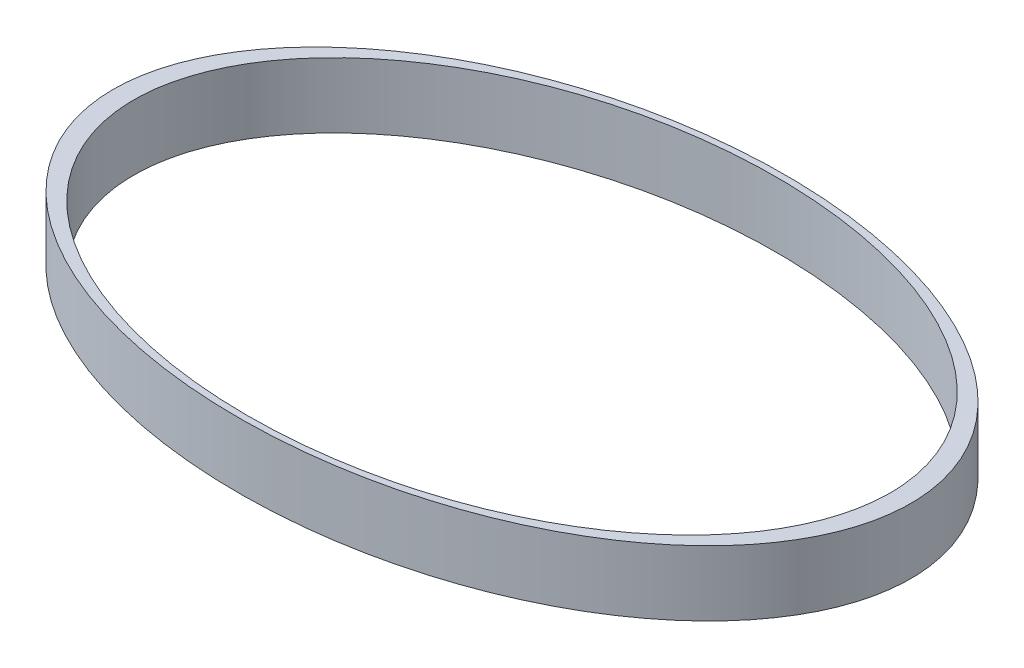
ISO-10303-21;
HEADER;
FILE_DESCRIPTION(('STEP AP214'),'2;1');
FILE_NAME('part.step','',(''),(''),'','','');
FILE_SCHEMA(('AUTOMOTIVE_DESIGN { 1 0 10303 214 1 1 1 1 }'));
ENDSEC;
DATA;
#1=APPLICATION_CONTEXT('core data for automotive mechanical design processes');
#2=APPLICATION_PROTOCOL_DEFINITION('international standard','automotive_design',2000,#1);
#3=PRODUCT_CONTEXT('',#1,'mechanical');
#4=PRODUCT('Part','Part','',(#3));
#5=PRODUCT_RELATED_PRODUCT_CATEGORY('part','',(#4));
#6=PRODUCT_DEFINITION_FORMATION('','',#4);
#7=PRODUCT_DEFINITION_CONTEXT('part definition',#1,'design');
#8=PRODUCT_DEFINITION('design','',#6,#7);
#9=PRODUCT_DEFINITION_SHAPE('','',#8);
#10=(LENGTH_UNIT() NAMED_UNIT(*) SI_UNIT(.MILLI.,.METRE.));
#11=(NAMED_UNIT(*) PLANE_ANGLE_UNIT() SI_UNIT($,.RADIAN.));
#12=(NAMED_UNIT(*) SI_UNIT($,.STERADIAN.) SOLID_ANGLE_UNIT());
#13=UNCERTAINTY_MEASURE_WITH_UNIT(LENGTH_MEASURE(1.E-05),#10,'distance_accuracy_value','');
#14=(GEOMETRIC_REPRESENTATION_CONTEXT(3) GLOBAL_UNCERTAINTY_ASSIGNED_CONTEXT((#13)) GLOBAL_UNIT_ASSIGNED_CONTEXT((#10,
#11,#12)) REPRESENTATION_CONTEXT('',''));
#15=CARTESIAN_POINT('',(0.,0.,0.));
#16=DIRECTION('',(0.,0.,1.));
#17=DIRECTION('',(1.,0.,0.));
#18=AXIS2_PLACEMENT_3D('',#15,#16,#17);
#19=CARTESIAN_POINT('',(181.503291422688,10.,2.13893643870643));
#20=DIRECTION('',(0.,1.,0.));
#21=DIRECTION('',(0.,0.,1.));
#22=AXIS2_PLACEMENT_3D('',#19,#20,#21);
#23=PLANE('',#22);
#24=CARTESIAN_POINT('',(181.503291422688,10.,2.13893643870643));
#25=DIRECTION('',(0.,1.,0.));
#26=DIRECTION('',(-0.996024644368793,0.,0.089078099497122));
#27=AXIS2_PLACEMENT_3D('',#24,#25,#26);
#28=ELLIPSE('',#27,58.2205142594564,36.8710238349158);
#29=CARTESIAN_POINT('',(123.514224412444,10.,7.3251092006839));
#30=VERTEX_POINT('',#29);
#31=EDGE_CURVE('E10',#30,#30,#28,.T.);
#32=ORIENTED_EDGE('',*,*,#31,.T.);
#33=EDGE_LOOP('',(#32));
#34=FACE_BOUND('',#33,.T.);
#35=CARTESIAN_POINT('',(181.503291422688,10.,2.13893643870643));
#36=DIRECTION('',(0.,1.,0.));
#37=DIRECTION('',(0.995811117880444,0.,-0.0914342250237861));
#38=AXIS2_PLACEMENT_3D('',#35,#36,#37);
#39=ELLIPSE('',#38,55.240939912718,35.920911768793);
#40=CARTESIAN_POINT('',(236.512833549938,10.,-2.91197609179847));
#41=VERTEX_POINT('',#40);
#42=EDGE_CURVE('E42',#41,#41,#39,.T.);
#43=ORIENTED_EDGE('',*,*,#42,.F.);
#44=EDGE_LOOP('',(#43));
#45=FACE_BOUND('',#44,.T.);
#46=ADVANCED_FACE('F31',(#34,#45),#23,.T.);
#47=CARTESIAN_POINT('',(181.503291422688,0.,2.13893643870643));
#48=DIRECTION('',(0.,1.,0.));
#49=DIRECTION('',(0.,0.,1.));
#50=AXIS2_PLACEMENT_3D('',#47,#48,#49);
#51=PLANE('',#50);
#52=CARTESIAN_POINT('',(181.503291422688,0.,2.13893643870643));
#53=DIRECTION('',(0.,1.,0.));
#54=DIRECTION('',(-0.996024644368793,0.,0.089078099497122));
#55=AXIS2_PLACEMENT_3D('',#52,#53,#54);
#56=ELLIPSE('',#55,58.2205142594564,36.8710238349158);
#57=CARTESIAN_POINT('',(123.514224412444,0.,7.3251092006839));
#58=VERTEX_POINT('',#57);
#59=EDGE_CURVE('E36',#58,#58,#56,.T.);
#60=ORIENTED_EDGE('',*,*,#59,.F.);
#61=EDGE_LOOP('',(#60));
#62=FACE_BOUND('',#61,.T.);
#63=CARTESIAN_POINT('',(181.503291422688,0.,2.13893643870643));
#64=DIRECTION('',(0.,1.,0.));
#65=DIRECTION('',(0.995811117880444,0.,-0.0914342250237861));
#66=AXIS2_PLACEMENT_3D('',#63,#64,#65);
#67=ELLIPSE('',#66,55.240939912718,35.920911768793);
#68=CARTESIAN_POINT('',(236.512833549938,0.,-2.91197609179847));
#69=VERTEX_POINT('',#68);
#70=EDGE_CURVE('E45',#69,#69,#67,.T.);
#71=ORIENTED_EDGE('',*,*,#70,.T.);
#72=EDGE_LOOP('',(#71));
#73=FACE_BOUND('',#72,.T.);
#74=ADVANCED_FACE('F56',(#62,#73),#51,.F.);
#75=DIRECTION('',(0.,-1.,0.));
#76=VECTOR('',#75,1.);
#77=SURFACE_OF_LINEAR_EXTRUSION('',#28,#76);
#78=ORIENTED_EDGE('',*,*,#31,.F.);
#79=EDGE_LOOP('',(#78));
#80=FACE_BOUND('',#79,.T.);
#81=ORIENTED_EDGE('',*,*,#59,.T.);
#82=EDGE_LOOP('',(#81));
#83=FACE_BOUND('',#82,.T.);
#84=ADVANCED_FACE('F33',(#80,#83),#77,.F.);
#85=DIRECTION('',(0.,-1.,0.));
#86=VECTOR('',#85,1.);
#87=SURFACE_OF_LINEAR_EXTRUSION('',#39,#86);
#88=ORIENTED_EDGE('',*,*,#42,.T.);
#89=EDGE_LOOP('',(#88));
#90=FACE_BOUND('',#89,.T.);
#91=ORIENTED_EDGE('',*,*,#70,.F.);
#92=EDGE_LOOP('',(#91));
#93=FACE_BOUND('',#92,.T.);
#94=ADVANCED_FACE('F51',(#90,#93),#87,.T.);
#95=CLOSED_SHELL('',(#46,#74,#84,#94));
#96=MANIFOLD_SOLID_BREP('B2',#95);
#97=ADVANCED_BREP_SHAPE_REPRESENTATION('',(#18,#96),#14);
#98=SHAPE_DEFINITION_REPRESENTATION(#9,#97);
ENDSEC;
END-ISO-10303-21;
